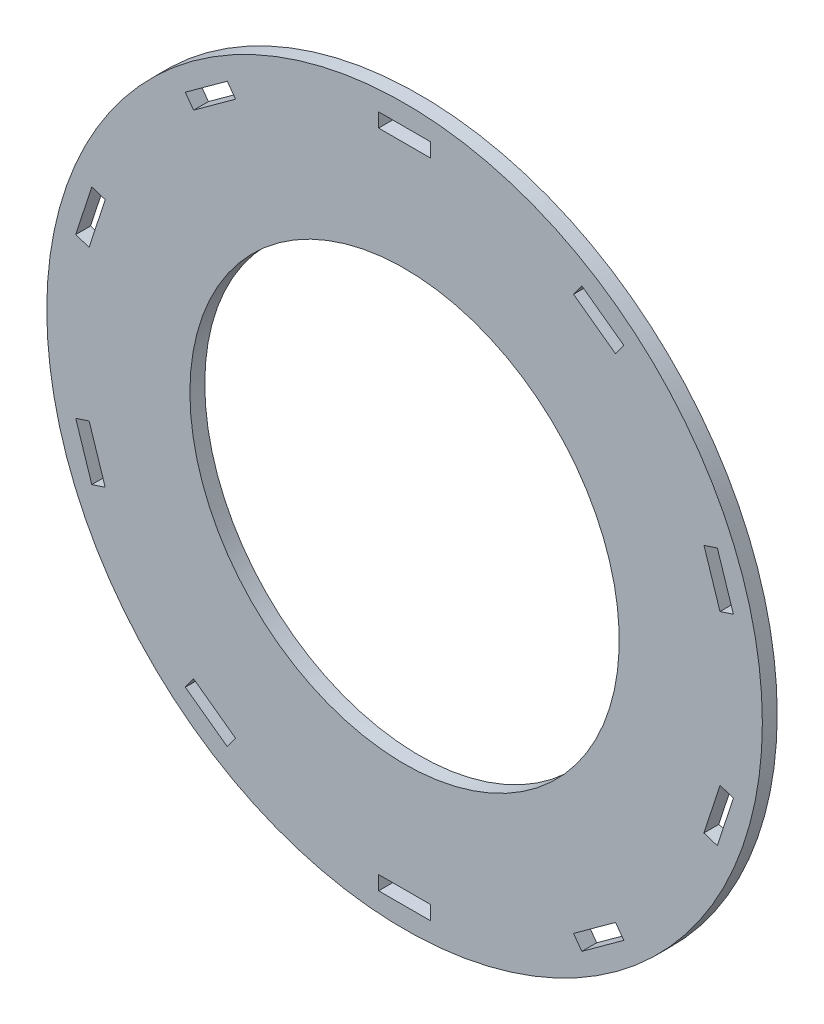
from build123d import *

# Parameters (mm, degrees)
SKETCH1_R           = 65
SKETCH1_R_2         = 39
SKETCH1_W           = 9.43
SKETCH1_H           = 2.56
BOSS_EXTRUDE1_DEPTH = 2.7


with BuildPart() as part:
    # Sketch1 → Boss-Extrude1 (new body)
    with BuildSketch(Plane.XY):
        with Locations(Location((0, 0, 0), (0, 0, 180))):
            Circle(SKETCH1_R)
        with Locations(Location((0, 0, 0), (0, 0, 180))):
            Circle(SKETCH1_R_2, mode=Mode.SUBTRACT)
        with Locations((0, 60)):
            Rectangle(SKETCH1_W, SKETCH1_H, mode=Mode.SUBTRACT)
        Polygon((30.700234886, 50.276885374), (38.329265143, 44.734070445), (39.833995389, 46.805153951), (32.204965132, 52.34796888), align=None, mode=Mode.SUBTRACT)
        Polygon((54.389023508, 22.629709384), (57.303053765, 13.661246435), (59.737758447, 14.452329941), (56.82372819, 23.42079289), align=None, mode=Mode.SUBTRACT)
        Polygon((57.303053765, -13.661246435), (54.389023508, -22.629709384), (56.82372819, -23.42079289), (59.737758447, -14.452329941), align=None, mode=Mode.SUBTRACT)
        Polygon((38.329265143, -44.734070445), (30.700234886, -50.276885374), (32.204965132, -52.34796888), (39.833995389, -46.805153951), align=None, mode=Mode.SUBTRACT)
        with Locations((0, -60)):
            Rectangle(SKETCH1_W, SKETCH1_H, mode=Mode.SUBTRACT)
        Polygon((-30.700234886, -50.276885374), (-38.329265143, -44.734070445), (-39.833995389, -46.805153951), (-32.204965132, -52.34796888), align=None, mode=Mode.SUBTRACT)
        Polygon((-54.389023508, -22.629709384), (-57.303053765, -13.661246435), (-59.737758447, -14.452329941), (-56.82372819, -23.42079289), align=None, mode=Mode.SUBTRACT)
        Polygon((-57.303053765, 13.661246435), (-54.389023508, 22.629709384), (-56.82372819, 23.42079289), (-59.737758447, 14.452329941), align=None, mode=Mode.SUBTRACT)
        Polygon((-38.329265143, 44.734070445), (-30.700234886, 50.276885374), (-32.204965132, 52.34796888), (-39.833995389, 46.805153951), align=None, mode=Mode.SUBTRACT)
    extrude(amount=BOSS_EXTRUDE1_DEPTH)


solid = part.part
